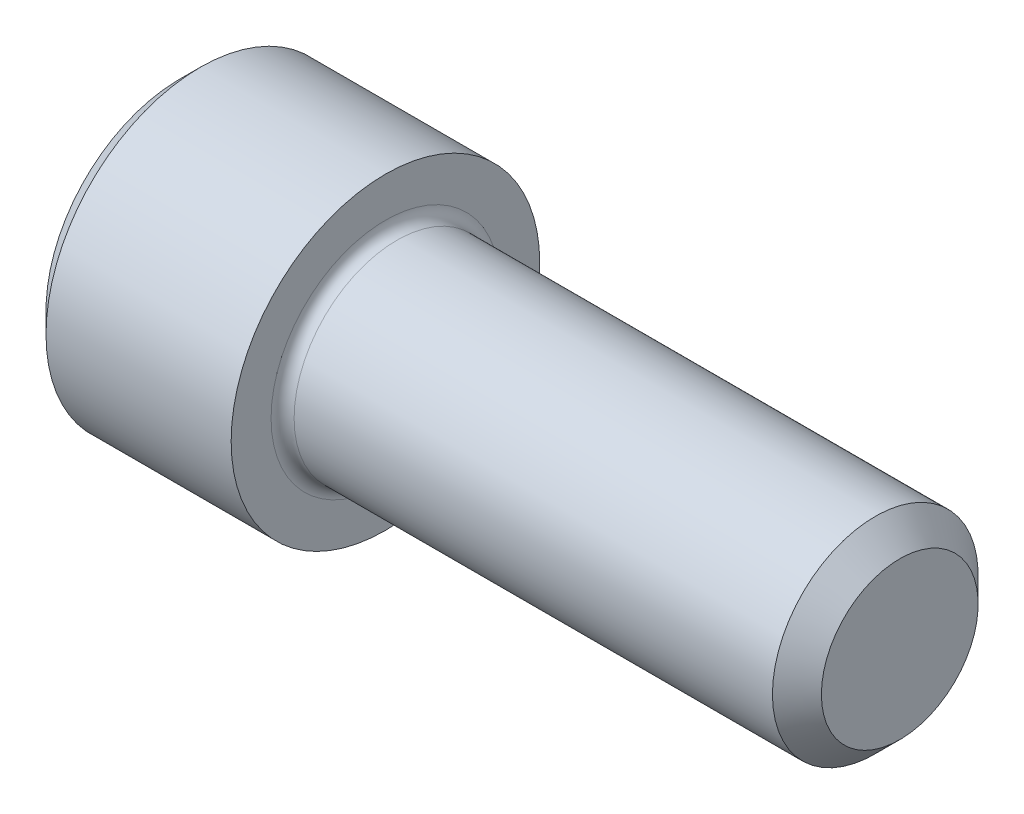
ISO-10303-21;
HEADER;
FILE_DESCRIPTION(('STEP AP214'),'2;1');
FILE_NAME('part.step','',(''),(''),'','','');
FILE_SCHEMA(('AUTOMOTIVE_DESIGN { 1 0 10303 214 1 1 1 1 }'));
ENDSEC;
DATA;
#1=APPLICATION_CONTEXT('core data for automotive mechanical design processes');
#2=APPLICATION_PROTOCOL_DEFINITION('international standard','automotive_design',2000,#1);
#3=PRODUCT_CONTEXT('',#1,'mechanical');
#4=PRODUCT('Part','Part','',(#3));
#5=PRODUCT_RELATED_PRODUCT_CATEGORY('part','',(#4));
#6=PRODUCT_DEFINITION_FORMATION('','',#4);
#7=PRODUCT_DEFINITION_CONTEXT('part definition',#1,'design');
#8=PRODUCT_DEFINITION('design','',#6,#7);
#9=PRODUCT_DEFINITION_SHAPE('','',#8);
#10=(LENGTH_UNIT() NAMED_UNIT(*) SI_UNIT(.MILLI.,.METRE.));
#11=(NAMED_UNIT(*) PLANE_ANGLE_UNIT() SI_UNIT($,.RADIAN.));
#12=(NAMED_UNIT(*) SI_UNIT($,.STERADIAN.) SOLID_ANGLE_UNIT());
#13=UNCERTAINTY_MEASURE_WITH_UNIT(LENGTH_MEASURE(1.E-05),#10,'distance_accuracy_value','');
#14=(GEOMETRIC_REPRESENTATION_CONTEXT(3) GLOBAL_UNCERTAINTY_ASSIGNED_CONTEXT((#13)) GLOBAL_UNIT_ASSIGNED_CONTEXT((#10,
#11,#12)) REPRESENTATION_CONTEXT('',''));
#15=CARTESIAN_POINT('',(0.,0.,0.));
#16=DIRECTION('',(0.,0.,1.));
#17=DIRECTION('',(1.,0.,0.));
#18=AXIS2_PLACEMENT_3D('',#15,#16,#17);
#19=CARTESIAN_POINT('',(3.048,1.3748153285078,2.38125));
#20=DIRECTION('',(-1.,0.,0.));
#21=DIRECTION('',(0.,0.,1.));
#22=AXIS2_PLACEMENT_3D('',#19,#20,#21);
#23=PLANE('',#22);
#24=DIRECTION('',(0.,0.500000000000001,0.866025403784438));
#25=VECTOR('',#24,1.);
#26=CARTESIAN_POINT('',(3.048,-2.06222299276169,1.190625));
#27=LINE('',#26,#25);
#28=CARTESIAN_POINT('',(3.04799999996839,-2.06222299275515,1.19062499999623));
#29=VERTEX_POINT('',#28);
#30=CARTESIAN_POINT('',(3.048,-1.37481532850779,2.38125));
#31=VERTEX_POINT('',#30);
#32=EDGE_CURVE('E100',#29,#31,#27,.T.);
#33=ORIENTED_EDGE('',*,*,#32,.T.);
#34=DIRECTION('',(0.,1.,0.));
#35=VECTOR('',#34,1.);
#36=CARTESIAN_POINT('',(3.048,1.3748153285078,2.38125));
#37=LINE('',#36,#35);
#38=CARTESIAN_POINT('',(3.04799999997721,0.,2.38124999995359));
#39=VERTEX_POINT('',#38);
#40=EDGE_CURVE('E95',#31,#39,#37,.T.);
#41=ORIENTED_EDGE('',*,*,#40,.T.);
#42=CARTESIAN_POINT('',(3.04799999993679,0.,0.));
#43=DIRECTION('',(-1.,0.,0.));
#44=DIRECTION('',(0.,0.,1.));
#45=AXIS2_PLACEMENT_3D('',#42,#43,#44);
#46=CIRCLE('',#45,2.3812499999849);
#47=EDGE_CURVE('E97',#39,#29,#46,.F.);
#48=ORIENTED_EDGE('',*,*,#47,.T.);
#49=EDGE_LOOP('',(#33,#41,#48));
#50=FACE_BOUND('',#49,.T.);
#51=ADVANCED_FACE('F16',(#50),#23,.T.);
#52=CARTESIAN_POINT('',(3.048,1.3748153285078,2.38125));
#53=DIRECTION('',(-1.,0.,0.));
#54=DIRECTION('',(0.,0.,1.));
#55=AXIS2_PLACEMENT_3D('',#52,#53,#54);
#56=PLANE('',#55);
#57=DIRECTION('',(0.,-0.499999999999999,0.866025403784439));
#58=VECTOR('',#57,1.);
#59=CARTESIAN_POINT('',(3.048,-2.06222299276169,-1.19062499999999));
#60=LINE('',#59,#58);
#61=CARTESIAN_POINT('',(3.04799999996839,-2.06222299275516,-1.19062499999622));
#62=VERTEX_POINT('',#61);
#63=CARTESIAN_POINT('',(3.048,-2.74963065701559,0.));
#64=VERTEX_POINT('',#63);
#65=EDGE_CURVE('E104',#62,#64,#60,.T.);
#66=ORIENTED_EDGE('',*,*,#65,.T.);
#67=DIRECTION('',(0.,0.500000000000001,0.866025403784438));
#68=VECTOR('',#67,1.);
#69=CARTESIAN_POINT('',(3.048,-2.74963065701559,0.));
#70=LINE('',#69,#68);
#71=EDGE_CURVE('E171',#64,#29,#70,.T.);
#72=ORIENTED_EDGE('',*,*,#71,.T.);
#73=CARTESIAN_POINT('',(3.04799999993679,0.,0.));
#74=DIRECTION('',(-1.,0.,0.));
#75=DIRECTION('',(0.,0.,1.));
#76=AXIS2_PLACEMENT_3D('',#73,#74,#75);
#77=CIRCLE('',#76,2.3812499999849);
#78=EDGE_CURVE('E116',#29,#62,#77,.F.);
#79=ORIENTED_EDGE('',*,*,#78,.T.);
#80=EDGE_LOOP('',(#66,#72,#79));
#81=FACE_BOUND('',#80,.T.);
#82=ADVANCED_FACE('F347',(#81),#56,.T.);
#83=CARTESIAN_POINT('',(3.048,1.3748153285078,2.38125));
#84=DIRECTION('',(-1.,0.,0.));
#85=DIRECTION('',(0.,0.,1.));
#86=AXIS2_PLACEMENT_3D('',#83,#84,#85);
#87=PLANE('',#86);
#88=DIRECTION('',(0.,1.,0.));
#89=VECTOR('',#88,1.);
#90=CARTESIAN_POINT('',(3.048,1.3748153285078,-2.38125));
#91=LINE('',#90,#89);
#92=CARTESIAN_POINT('',(3.04799999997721,1.5682321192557E-13,-2.38124999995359));
#93=VERTEX_POINT('',#92);
#94=CARTESIAN_POINT('',(3.048,-1.37481532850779,-2.38125));
#95=VERTEX_POINT('',#94);
#96=EDGE_CURVE('E166',#93,#95,#91,.F.);
#97=ORIENTED_EDGE('',*,*,#96,.T.);
#98=DIRECTION('',(0.,-0.499999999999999,0.86602540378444));
#99=VECTOR('',#98,1.);
#100=CARTESIAN_POINT('',(3.048,-1.37481532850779,-2.38125));
#101=LINE('',#100,#99);
#102=EDGE_CURVE('E161',#95,#62,#101,.T.);
#103=ORIENTED_EDGE('',*,*,#102,.T.);
#104=CARTESIAN_POINT('',(3.04799999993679,0.,0.));
#105=DIRECTION('',(-1.,0.,0.));
#106=DIRECTION('',(0.,0.,1.));
#107=AXIS2_PLACEMENT_3D('',#104,#105,#106);
#108=CIRCLE('',#107,2.3812499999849);
#109=EDGE_CURVE('E224',#62,#93,#108,.F.);
#110=ORIENTED_EDGE('',*,*,#109,.T.);
#111=EDGE_LOOP('',(#97,#103,#110));
#112=FACE_BOUND('',#111,.T.);
#113=ADVANCED_FACE('F344',(#112),#87,.T.);
#114=CARTESIAN_POINT('',(3.048,1.3748153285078,2.38125));
#115=DIRECTION('',(-1.,0.,0.));
#116=DIRECTION('',(0.,0.,1.));
#117=AXIS2_PLACEMENT_3D('',#114,#115,#116);
#118=PLANE('',#117);
#119=DIRECTION('',(0.,-0.500000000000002,-0.866025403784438));
#120=VECTOR('',#119,1.);
#121=CARTESIAN_POINT('',(3.048,2.0622229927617,-1.19062500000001));
#122=LINE('',#121,#120);
#123=CARTESIAN_POINT('',(3.04799999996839,2.06222299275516,-1.19062499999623));
#124=VERTEX_POINT('',#123);
#125=CARTESIAN_POINT('',(3.048,1.3748153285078,-2.38125));
#126=VERTEX_POINT('',#125);
#127=EDGE_CURVE('E156',#124,#126,#122,.T.);
#128=ORIENTED_EDGE('',*,*,#127,.T.);
#129=DIRECTION('',(0.,1.,0.));
#130=VECTOR('',#129,1.);
#131=CARTESIAN_POINT('',(3.048,1.3748153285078,-2.38125));
#132=LINE('',#131,#130);
#133=EDGE_CURVE('E151',#126,#93,#132,.F.);
#134=ORIENTED_EDGE('',*,*,#133,.T.);
#135=CARTESIAN_POINT('',(3.04799999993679,0.,0.));
#136=DIRECTION('',(-1.,0.,0.));
#137=DIRECTION('',(0.,0.,1.));
#138=AXIS2_PLACEMENT_3D('',#135,#136,#137);
#139=CIRCLE('',#138,2.3812499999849);
#140=EDGE_CURVE('E221',#93,#124,#139,.F.);
#141=ORIENTED_EDGE('',*,*,#140,.T.);
#142=EDGE_LOOP('',(#128,#134,#141));
#143=FACE_BOUND('',#142,.T.);
#144=ADVANCED_FACE('F340',(#143),#118,.T.);
#145=CARTESIAN_POINT('',(3.048,1.3748153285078,2.38125));
#146=DIRECTION('',(-1.,0.,0.));
#147=DIRECTION('',(0.,0.,1.));
#148=AXIS2_PLACEMENT_3D('',#145,#146,#147);
#149=PLANE('',#148);
#150=DIRECTION('',(0.,0.500000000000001,-0.866025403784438));
#151=VECTOR('',#150,1.);
#152=CARTESIAN_POINT('',(3.048,2.0622229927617,1.190625));
#153=LINE('',#152,#151);
#154=CARTESIAN_POINT('',(3.04799999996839,2.06222299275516,1.19062499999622));
#155=VERTEX_POINT('',#154);
#156=CARTESIAN_POINT('',(3.048,2.7496306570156,0.));
#157=VERTEX_POINT('',#156);
#158=EDGE_CURVE('E146',#155,#157,#153,.T.);
#159=ORIENTED_EDGE('',*,*,#158,.T.);
#160=DIRECTION('',(0.,-0.500000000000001,-0.866025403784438));
#161=VECTOR('',#160,1.);
#162=CARTESIAN_POINT('',(3.048,2.7496306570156,0.));
#163=LINE('',#162,#161);
#164=EDGE_CURVE('E117',#157,#124,#163,.T.);
#165=ORIENTED_EDGE('',*,*,#164,.T.);
#166=CARTESIAN_POINT('',(3.04799999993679,0.,0.));
#167=DIRECTION('',(-1.,0.,0.));
#168=DIRECTION('',(0.,0.,1.));
#169=AXIS2_PLACEMENT_3D('',#166,#167,#168);
#170=CIRCLE('',#169,2.3812499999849);
#171=EDGE_CURVE('E124',#124,#155,#170,.F.);
#172=ORIENTED_EDGE('',*,*,#171,.T.);
#173=EDGE_LOOP('',(#159,#165,#172));
#174=FACE_BOUND('',#173,.T.);
#175=ADVANCED_FACE('F336',(#174),#149,.T.);
#176=CARTESIAN_POINT('',(3.04800000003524,0.,0.));
#177=DIRECTION('',(-1.,0.,0.));
#178=DIRECTION('',(0.,0.,1.));
#179=AXIS2_PLACEMENT_3D('',#176,#177,#178);
#180=CONICAL_SURFACE('',#179,2.38124999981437,1.04719755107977);
#181=CARTESIAN_POINT('',(4.42281532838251,0.,5.6843418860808E-11));
#182=VERTEX_POINT('',#181);
#183=VERTEX_LOOP('',#182);
#184=FACE_BOUND('',#183,.T.);
#185=ORIENTED_EDGE('',*,*,#47,.F.);
#186=CARTESIAN_POINT('',(3.04799999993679,0.,0.));
#187=DIRECTION('',(-1.,0.,0.));
#188=DIRECTION('',(0.,0.,1.));
#189=AXIS2_PLACEMENT_3D('',#186,#187,#188);
#190=CIRCLE('',#189,2.3812499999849);
#191=EDGE_CURVE('E112',#155,#39,#190,.F.);
#192=ORIENTED_EDGE('',*,*,#191,.F.);
#193=ORIENTED_EDGE('',*,*,#171,.F.);
#194=ORIENTED_EDGE('',*,*,#140,.F.);
#195=ORIENTED_EDGE('',*,*,#109,.F.);
#196=ORIENTED_EDGE('',*,*,#78,.F.);
#197=EDGE_LOOP('',(#185,#192,#193,#194,#195,#196));
#198=FACE_BOUND('',#197,.T.);
#199=ADVANCED_FACE('F110',(#184,#198),#180,.F.);
#200=CARTESIAN_POINT('',(3.048,1.3748153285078,2.38125));
#201=DIRECTION('',(-1.,0.,0.));
#202=DIRECTION('',(0.,0.,1.));
#203=AXIS2_PLACEMENT_3D('',#200,#201,#202);
#204=PLANE('',#203);
#205=DIRECTION('',(0.,-1.,0.));
#206=VECTOR('',#205,1.);
#207=CARTESIAN_POINT('',(3.048,-1.37481532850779,2.38125));
#208=LINE('',#207,#206);
#209=CARTESIAN_POINT('',(3.048,1.3748153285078,2.38125));
#210=VERTEX_POINT('',#209);
#211=EDGE_CURVE('E121',#39,#210,#208,.F.);
#212=ORIENTED_EDGE('',*,*,#211,.T.);
#213=DIRECTION('',(0.,0.499999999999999,-0.866025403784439));
#214=VECTOR('',#213,1.);
#215=CARTESIAN_POINT('',(3.048,2.7496306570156,0.));
#216=LINE('',#215,#214);
#217=EDGE_CURVE('E123',#155,#210,#216,.F.);
#218=ORIENTED_EDGE('',*,*,#217,.F.);
#219=ORIENTED_EDGE('',*,*,#191,.T.);
#220=EDGE_LOOP('',(#212,#218,#219));
#221=FACE_BOUND('',#220,.T.);
#222=ADVANCED_FACE('F120',(#221),#204,.T.);
#223=CARTESIAN_POINT('',(3.048,2.7496306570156,0.));
#224=DIRECTION('',(0.,-0.866025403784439,-0.499999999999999));
#225=DIRECTION('',(0.,0.499999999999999,-0.866025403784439));
#226=AXIS2_PLACEMENT_3D('',#223,#224,#225);
#227=PLANE('',#226);
#228=ORIENTED_EDGE('',*,*,#217,.T.);
#229=DIRECTION('',(1.,0.,0.));
#230=VECTOR('',#229,1.);
#231=CARTESIAN_POINT('',(3.048,1.3748153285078,2.38125));
#232=LINE('',#231,#230);
#233=CARTESIAN_POINT('',(0.,1.3748153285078,2.38125));
#234=VERTEX_POINT('',#233);
#235=EDGE_CURVE('E129',#210,#234,#232,.F.);
#236=ORIENTED_EDGE('',*,*,#235,.T.);
#237=DIRECTION('',(0.,-0.499999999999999,0.866025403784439));
#238=VECTOR('',#237,1.);
#239=CARTESIAN_POINT('',(0.,2.7496306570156,0.));
#240=LINE('',#239,#238);
#241=CARTESIAN_POINT('',(0.,2.7496306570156,0.));
#242=VERTEX_POINT('',#241);
#243=EDGE_CURVE('E136',#242,#234,#240,.T.);
#244=ORIENTED_EDGE('',*,*,#243,.F.);
#245=DIRECTION('',(1.,0.,0.));
#246=VECTOR('',#245,1.);
#247=CARTESIAN_POINT('',(3.048,2.7496306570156,0.));
#248=LINE('',#247,#246);
#249=EDGE_CURVE('E186',#242,#157,#248,.T.);
#250=ORIENTED_EDGE('',*,*,#249,.T.);
#251=ORIENTED_EDGE('',*,*,#158,.F.);
#252=EDGE_LOOP('',(#228,#236,#244,#250,#251));
#253=FACE_BOUND('',#252,.T.);
#254=ADVANCED_FACE('F328',(#253),#227,.T.);
#255=CARTESIAN_POINT('',(3.048,-1.37481532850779,2.38125));
#256=DIRECTION('',(0.,0.,1.));
#257=DIRECTION('',(0.,-1.,0.));
#258=AXIS2_PLACEMENT_3D('',#255,#256,#257);
#259=PLANE('',#258);
#260=ORIENTED_EDGE('',*,*,#235,.F.);
#261=ORIENTED_EDGE('',*,*,#211,.F.);
#262=ORIENTED_EDGE('',*,*,#40,.F.);
#263=DIRECTION('',(1.,0.,0.));
#264=VECTOR('',#263,1.);
#265=CARTESIAN_POINT('',(3.048,-1.37481532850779,2.38125));
#266=LINE('',#265,#264);
#267=CARTESIAN_POINT('',(0.,-1.37481532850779,2.38125));
#268=VERTEX_POINT('',#267);
#269=EDGE_CURVE('E131',#268,#31,#266,.T.);
#270=ORIENTED_EDGE('',*,*,#269,.F.);
#271=DIRECTION('',(0.,1.,0.));
#272=VECTOR('',#271,1.);
#273=CARTESIAN_POINT('',(0.,0.,2.38125));
#274=LINE('',#273,#272);
#275=EDGE_CURVE('E362',#234,#268,#274,.F.);
#276=ORIENTED_EDGE('',*,*,#275,.F.);
#277=EDGE_LOOP('',(#260,#261,#262,#270,#276));
#278=FACE_BOUND('',#277,.T.);
#279=ADVANCED_FACE('F127',(#278),#259,.F.);
#280=CARTESIAN_POINT('',(3.048,-1.37481532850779,2.38125));
#281=DIRECTION('',(0.,0.866025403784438,-0.500000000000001));
#282=DIRECTION('',(0.,0.500000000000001,0.866025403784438));
#283=AXIS2_PLACEMENT_3D('',#280,#281,#282);
#284=PLANE('',#283);
#285=ORIENTED_EDGE('',*,*,#71,.F.);
#286=DIRECTION('',(1.,0.,0.));
#287=VECTOR('',#286,1.);
#288=CARTESIAN_POINT('',(3.048,-2.74963065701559,0.));
#289=LINE('',#288,#287);
#290=CARTESIAN_POINT('',(0.,-2.74963065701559,0.));
#291=VERTEX_POINT('',#290);
#292=EDGE_CURVE('E197',#291,#64,#289,.T.);
#293=ORIENTED_EDGE('',*,*,#292,.F.);
#294=DIRECTION('',(0.,-0.500000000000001,-0.866025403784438));
#295=VECTOR('',#294,1.);
#296=CARTESIAN_POINT('',(0.,-1.37481532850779,2.38125));
#297=LINE('',#296,#295);
#298=EDGE_CURVE('E360',#268,#291,#297,.T.);
#299=ORIENTED_EDGE('',*,*,#298,.F.);
#300=ORIENTED_EDGE('',*,*,#269,.T.);
#301=ORIENTED_EDGE('',*,*,#32,.F.);
#302=EDGE_LOOP('',(#285,#293,#299,#300,#301));
#303=FACE_BOUND('',#302,.T.);
#304=ADVANCED_FACE('F321',(#303),#284,.T.);
#305=CARTESIAN_POINT('',(3.048,-2.74963065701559,0.));
#306=DIRECTION('',(0.,0.86602540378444,0.499999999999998));
#307=DIRECTION('',(0.,-0.499999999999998,0.86602540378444));
#308=AXIS2_PLACEMENT_3D('',#305,#306,#307);
#309=PLANE('',#308);
#310=ORIENTED_EDGE('',*,*,#102,.F.);
#311=DIRECTION('',(1.,0.,0.));
#312=VECTOR('',#311,1.);
#313=CARTESIAN_POINT('',(3.048,-1.37481532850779,-2.38125));
#314=LINE('',#313,#312);
#315=CARTESIAN_POINT('',(0.,-1.37481532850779,-2.38125));
#316=VERTEX_POINT('',#315);
#317=EDGE_CURVE('E190',#95,#316,#314,.F.);
#318=ORIENTED_EDGE('',*,*,#317,.T.);
#319=DIRECTION('',(0.,0.499999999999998,-0.86602540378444));
#320=VECTOR('',#319,1.);
#321=CARTESIAN_POINT('',(0.,-2.74963065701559,0.));
#322=LINE('',#321,#320);
#323=EDGE_CURVE('E357',#291,#316,#322,.T.);
#324=ORIENTED_EDGE('',*,*,#323,.F.);
#325=ORIENTED_EDGE('',*,*,#292,.T.);
#326=ORIENTED_EDGE('',*,*,#65,.F.);
#327=EDGE_LOOP('',(#310,#318,#324,#325,#326));
#328=FACE_BOUND('',#327,.T.);
#329=ADVANCED_FACE('F317',(#328),#309,.T.);
#330=CARTESIAN_POINT('',(3.048,1.3748153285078,-2.38125));
#331=DIRECTION('',(0.,0.,-1.));
#332=DIRECTION('',(0.,1.,0.));
#333=AXIS2_PLACEMENT_3D('',#330,#331,#332);
#334=PLANE('',#333);
#335=ORIENTED_EDGE('',*,*,#317,.F.);
#336=ORIENTED_EDGE('',*,*,#96,.F.);
#337=ORIENTED_EDGE('',*,*,#133,.F.);
#338=DIRECTION('',(1.,0.,0.));
#339=VECTOR('',#338,1.);
#340=CARTESIAN_POINT('',(3.048,1.3748153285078,-2.38125));
#341=LINE('',#340,#339);
#342=CARTESIAN_POINT('',(0.,1.3748153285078,-2.38125));
#343=VERTEX_POINT('',#342);
#344=EDGE_CURVE('E189',#126,#343,#341,.F.);
#345=ORIENTED_EDGE('',*,*,#344,.T.);
#346=DIRECTION('',(0.,1.,0.));
#347=VECTOR('',#346,1.);
#348=CARTESIAN_POINT('',(0.,0.,-2.38125));
#349=LINE('',#348,#347);
#350=EDGE_CURVE('E372',#316,#343,#349,.T.);
#351=ORIENTED_EDGE('',*,*,#350,.F.);
#352=EDGE_LOOP('',(#335,#336,#337,#345,#351));
#353=FACE_BOUND('',#352,.T.);
#354=ADVANCED_FACE('F313',(#353),#334,.F.);
#355=CARTESIAN_POINT('',(3.048,2.7496306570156,0.));
#356=DIRECTION('',(0.,0.866025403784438,-0.500000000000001));
#357=DIRECTION('',(0.,0.500000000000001,0.866025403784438));
#358=AXIS2_PLACEMENT_3D('',#355,#356,#357);
#359=PLANE('',#358);
#360=ORIENTED_EDGE('',*,*,#344,.F.);
#361=ORIENTED_EDGE('',*,*,#127,.F.);
#362=ORIENTED_EDGE('',*,*,#164,.F.);
#363=ORIENTED_EDGE('',*,*,#249,.F.);
#364=DIRECTION('',(0.,0.500000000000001,0.866025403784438));
#365=VECTOR('',#364,1.);
#366=CARTESIAN_POINT('',(0.,1.3748153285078,-2.38125));
#367=LINE('',#366,#365);
#368=EDGE_CURVE('E217',#343,#242,#367,.T.);
#369=ORIENTED_EDGE('',*,*,#368,.F.);
#370=EDGE_LOOP('',(#360,#361,#362,#363,#369));
#371=FACE_BOUND('',#370,.T.);
#372=ADVANCED_FACE('F309',(#371),#359,.F.);
#373=CARTESIAN_POINT('',(0.,0.,0.));
#374=DIRECTION('',(-1.,0.,0.));
#375=DIRECTION('',(0.,0.,1.));
#376=AXIS2_PLACEMENT_3D('',#373,#374,#375);
#377=PLANE('',#376);
#378=CARTESIAN_POINT('',(0.,0.,0.));
#379=DIRECTION('',(1.,0.,0.));
#380=DIRECTION('',(0.,0.,-1.));
#381=AXIS2_PLACEMENT_3D('',#378,#379,#380);
#382=CIRCLE('',#381,4.12749999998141);
#383=CARTESIAN_POINT('',(0.,0.,-4.12749999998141));
#384=VERTEX_POINT('',#383);
#385=EDGE_CURVE('E215',#384,#384,#382,.T.);
#386=ORIENTED_EDGE('',*,*,#385,.F.);
#387=EDGE_LOOP('',(#386));
#388=FACE_BOUND('',#387,.T.);
#389=ORIENTED_EDGE('',*,*,#350,.T.);
#390=ORIENTED_EDGE('',*,*,#368,.T.);
#391=ORIENTED_EDGE('',*,*,#243,.T.);
#392=ORIENTED_EDGE('',*,*,#275,.T.);
#393=ORIENTED_EDGE('',*,*,#298,.T.);
#394=ORIENTED_EDGE('',*,*,#323,.T.);
#395=EDGE_LOOP('',(#389,#390,#391,#392,#393,#394));
#396=FACE_BOUND('',#395,.T.);
#397=ADVANCED_FACE('F301',(#388,#396),#377,.T.);
#398=CARTESIAN_POINT('',(0.635000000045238,0.,0.));
#399=DIRECTION('',(1.,0.,0.));
#400=DIRECTION('',(0.,0.,-1.));
#401=AXIS2_PLACEMENT_3D('',#398,#399,#400);
#402=CONICAL_SURFACE('',#401,4.76250000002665,0.785398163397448);
#403=ORIENTED_EDGE('',*,*,#385,.T.);
#404=EDGE_LOOP('',(#403));
#405=FACE_BOUND('',#404,.T.);
#406=CARTESIAN_POINT('',(0.635000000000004,0.,0.));
#407=DIRECTION('',(-1.,0.,0.));
#408=DIRECTION('',(0.,0.,1.));
#409=AXIS2_PLACEMENT_3D('',#406,#407,#408);
#410=CIRCLE('',#409,4.7625);
#411=CARTESIAN_POINT('',(0.635000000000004,0.,4.7625));
#412=VERTEX_POINT('',#411);
#413=EDGE_CURVE('E214',#412,#412,#410,.F.);
#414=ORIENTED_EDGE('',*,*,#413,.F.);
#415=EDGE_LOOP('',(#414));
#416=FACE_BOUND('',#415,.T.);
#417=ADVANCED_FACE('F296',(#405,#416),#402,.T.);
#418=CARTESIAN_POINT('',(-31.75,0.,0.));
#419=DIRECTION('',(-1.,0.,0.));
#420=DIRECTION('',(0.,0.,1.));
#421=AXIS2_PLACEMENT_3D('',#418,#419,#420);
#422=CYLINDRICAL_SURFACE('',#421,4.7625);
#423=CARTESIAN_POINT('',(6.35,0.,0.));
#424=DIRECTION('',(-1.,0.,0.));
#425=DIRECTION('',(0.,0.,1.));
#426=AXIS2_PLACEMENT_3D('',#423,#424,#425);
#427=CIRCLE('',#426,4.7625);
#428=CARTESIAN_POINT('',(6.35,0.,4.7625));
#429=VERTEX_POINT('',#428);
#430=EDGE_CURVE('E211',#429,#429,#427,.F.);
#431=ORIENTED_EDGE('',*,*,#430,.F.);
#432=EDGE_LOOP('',(#431));
#433=FACE_BOUND('',#432,.T.);
#434=ORIENTED_EDGE('',*,*,#413,.T.);
#435=EDGE_LOOP('',(#434));
#436=FACE_BOUND('',#435,.T.);
#437=ADVANCED_FACE('F292',(#433,#436),#422,.T.);
#438=CARTESIAN_POINT('',(22.225,2.41935,0.));
#439=DIRECTION('',(1.,0.,0.));
#440=DIRECTION('',(0.,0.,-1.));
#441=AXIS2_PLACEMENT_3D('',#438,#439,#440);
#442=PLANE('',#441);
#443=CARTESIAN_POINT('',(22.2249999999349,0.,0.));
#444=DIRECTION('',(-1.,0.,0.));
#445=DIRECTION('',(0.,0.,1.));
#446=AXIS2_PLACEMENT_3D('',#443,#444,#445);
#447=CIRCLE('',#446,2.41935000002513);
#448=CARTESIAN_POINT('',(22.2249999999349,0.,2.41935000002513));
#449=VERTEX_POINT('',#448);
#450=EDGE_CURVE('E207',#449,#449,#447,.T.);
#451=ORIENTED_EDGE('',*,*,#450,.F.);
#452=EDGE_LOOP('',(#451));
#453=FACE_BOUND('',#452,.T.);
#454=ADVANCED_FACE('F250',(#453),#442,.T.);
#455=CARTESIAN_POINT('',(6.35,4.7625,0.));
#456=DIRECTION('',(1.,0.,0.));
#457=DIRECTION('',(0.,0.,-1.));
#458=AXIS2_PLACEMENT_3D('',#455,#456,#457);
#459=PLANE('',#458);
#460=ORIENTED_EDGE('',*,*,#430,.T.);
#461=EDGE_LOOP('',(#460));
#462=FACE_BOUND('',#461,.T.);
#463=CARTESIAN_POINT('',(6.35,0.,0.));
#464=DIRECTION('',(1.,0.,0.));
#465=DIRECTION('',(0.,0.,1.));
#466=AXIS2_PLACEMENT_3D('',#463,#464,#465);
#467=CIRCLE('',#466,3.5306);
#468=CARTESIAN_POINT('',(6.35,0.,-3.5306));
#469=VERTEX_POINT('',#468);
#470=CARTESIAN_POINT('',(6.35,0.,3.5306));
#471=VERTEX_POINT('',#470);
#472=EDGE_CURVE('E210',#469,#471,#467,.F.);
#473=ORIENTED_EDGE('',*,*,#472,.T.);
#474=CARTESIAN_POINT('',(6.35,0.,0.));
#475=DIRECTION('',(1.,0.,0.));
#476=DIRECTION('',(0.,0.,-1.));
#477=AXIS2_PLACEMENT_3D('',#474,#475,#476);
#478=CIRCLE('',#477,3.5306);
#479=EDGE_CURVE('E35',#471,#469,#478,.F.);
#480=ORIENTED_EDGE('',*,*,#479,.T.);
#481=EDGE_LOOP('',(#473,#480));
#482=FACE_BOUND('',#481,.T.);
#483=ADVANCED_FACE('F231',(#462,#482),#459,.T.);
#484=CARTESIAN_POINT('',(21.4693500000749,0.,0.));
#485=DIRECTION('',(-1.,0.,0.));
#486=DIRECTION('',(0.,0.,1.));
#487=AXIS2_PLACEMENT_3D('',#484,#485,#486);
#488=CONICAL_SURFACE('',#487,3.17499999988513,0.785398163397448);
#489=CARTESIAN_POINT('',(21.46935,0.,0.));
#490=DIRECTION('',(-1.,0.,0.));
#491=DIRECTION('',(0.,0.,1.));
#492=AXIS2_PLACEMENT_3D('',#489,#490,#491);
#493=CIRCLE('',#492,3.175);
#494=CARTESIAN_POINT('',(21.46935,0.,3.175));
#495=VERTEX_POINT('',#494);
#496=EDGE_CURVE('E27',#495,#495,#493,.T.);
#497=ORIENTED_EDGE('',*,*,#496,.F.);
#498=EDGE_LOOP('',(#497));
#499=FACE_BOUND('',#498,.T.);
#500=ORIENTED_EDGE('',*,*,#450,.T.);
#501=EDGE_LOOP('',(#500));
#502=FACE_BOUND('',#501,.T.);
#503=ADVANCED_FACE('F249',(#499,#502),#488,.T.);
#504=CARTESIAN_POINT('',(6.7056,0.,0.));
#505=DIRECTION('',(1.,0.,0.));
#506=DIRECTION('',(0.,0.,-1.));
#507=AXIS2_PLACEMENT_3D('',#504,#505,#506);
#508=TOROIDAL_SURFACE('',#507,3.5306,0.3556);
#509=CARTESIAN_POINT('',(6.7056,0.,0.));
#510=DIRECTION('',(-1.,0.,0.));
#511=DIRECTION('',(0.,0.,1.));
#512=AXIS2_PLACEMENT_3D('',#509,#510,#511);
#513=CIRCLE('',#512,3.175);
#514=CARTESIAN_POINT('',(6.7056,0.,3.175));
#515=VERTEX_POINT('',#514);
#516=EDGE_CURVE('E11',#515,#515,#513,.F.);
#517=ORIENTED_EDGE('',*,*,#516,.F.);
#518=EDGE_LOOP('',(#517));
#519=FACE_BOUND('',#518,.T.);
#520=ORIENTED_EDGE('',*,*,#472,.F.);
#521=ORIENTED_EDGE('',*,*,#479,.F.);
#522=EDGE_LOOP('',(#520,#521));
#523=FACE_BOUND('',#522,.T.);
#524=ADVANCED_FACE('F228',(#519,#523),#508,.F.);
#525=CARTESIAN_POINT('',(-31.75,0.,0.));
#526=DIRECTION('',(-1.,0.,0.));
#527=DIRECTION('',(0.,0.,1.));
#528=AXIS2_PLACEMENT_3D('',#525,#526,#527);
#529=CYLINDRICAL_SURFACE('',#528,3.175);
#530=ORIENTED_EDGE('',*,*,#516,.T.);
#531=EDGE_LOOP('',(#530));
#532=FACE_BOUND('',#531,.T.);
#533=ORIENTED_EDGE('',*,*,#496,.T.);
#534=EDGE_LOOP('',(#533));
#535=FACE_BOUND('',#534,.T.);
#536=ADVANCED_FACE('F274',(#532,#535),#529,.T.);
#537=CLOSED_SHELL('',(#51,#82,#113,#144,#175,#199,#222,#254,#279,#304,#329,#354,#372,#397,#417,
#437,#454,#483,#503,#524,#536));
#538=MANIFOLD_SOLID_BREP('B1',#537);
#539=ADVANCED_BREP_SHAPE_REPRESENTATION('',(#18,#538),#14);
#540=SHAPE_DEFINITION_REPRESENTATION(#9,#539);
ENDSEC;
END-ISO-10303-21;
